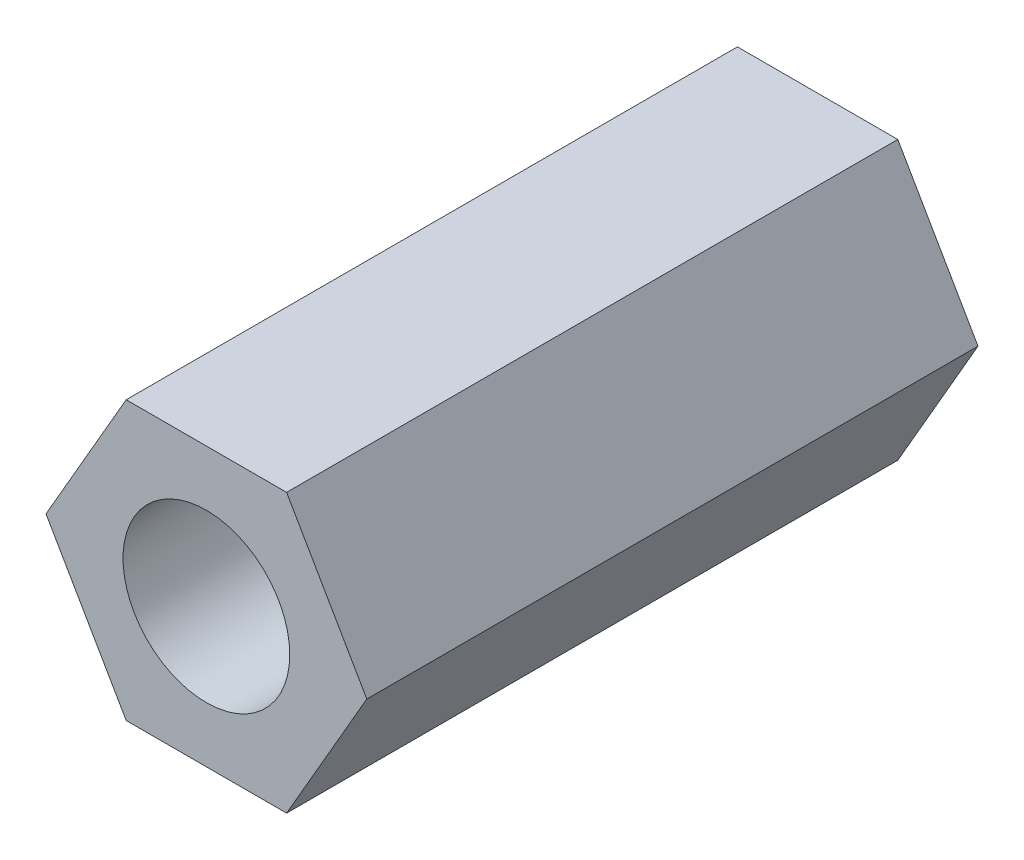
from build123d import *

# Parameters (mm, degrees)
ESQUISSE1_R             = 1.25
EXTRUSION1_DEPTH        = 11
ESQUISSE2_R             = 1.5
ENL_V_MAT_EXTRU_1_DEPTH = 4


with BuildPart() as part:
    # Esquisse1 → Extrusion1 (new body)
    with BuildSketch(Plane.XY):
        Polygon((2.886751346, 0), (1.443375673, 2.5), (-1.443375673, 2.5), (-2.886751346, 0), (-1.443375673, -2.5), (1.443375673, -2.5), align=None)
        Circle(ESQUISSE1_R, mode=Mode.SUBTRACT)
    extrude(amount=EXTRUSION1_DEPTH)

    # Esquisse2 → Enl_v. mat.-Extru.1 (cut)
    with BuildSketch(Plane.XY.offset(11)):
        Circle(ESQUISSE2_R)
    extrude(amount=-ENL_V_MAT_EXTRU_1_DEPTH, mode=Mode.SUBTRACT)


solid = part.part
